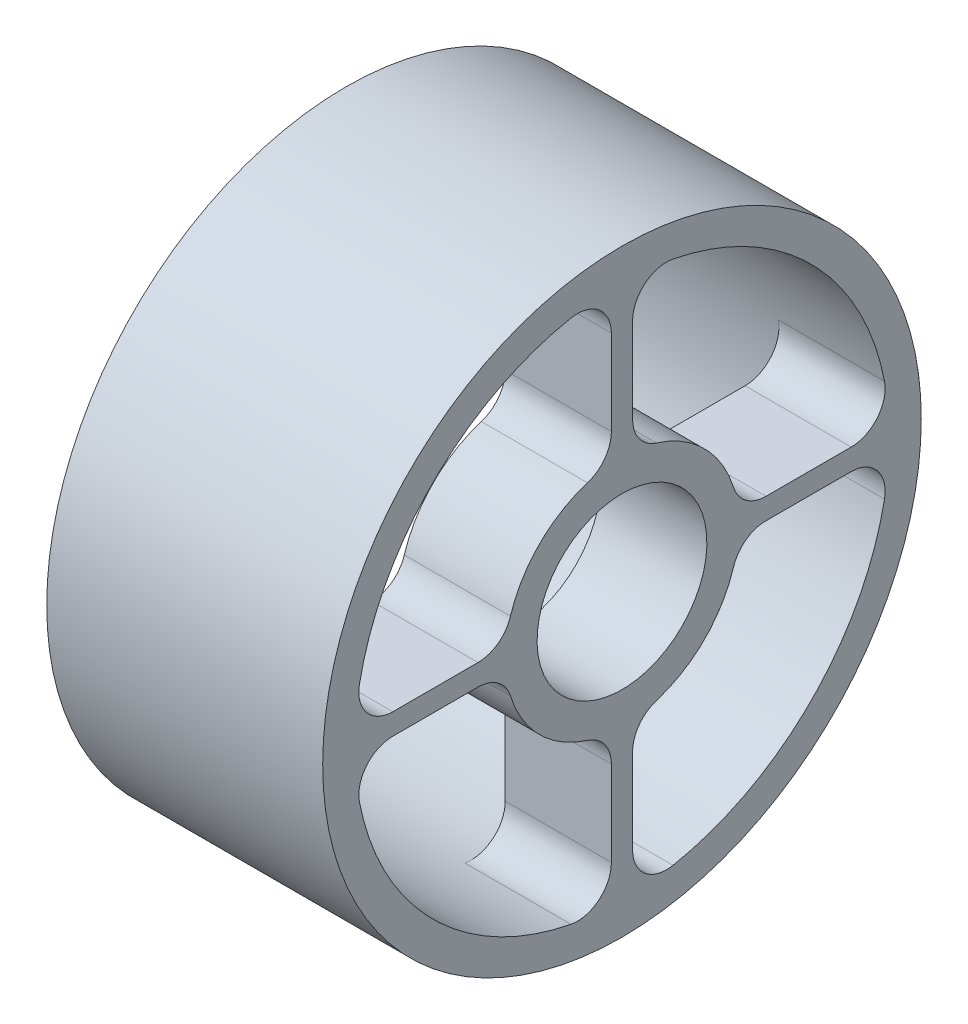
ISO-10303-21;
HEADER;
FILE_DESCRIPTION(('STEP AP214'),'2;1');
FILE_NAME('part.step','',(''),(''),'','','');
FILE_SCHEMA(('AUTOMOTIVE_DESIGN { 1 0 10303 214 1 1 1 1 }'));
ENDSEC;
DATA;
#1=APPLICATION_CONTEXT('core data for automotive mechanical design processes');
#2=APPLICATION_PROTOCOL_DEFINITION('international standard','automotive_design',2000,#1);
#3=PRODUCT_CONTEXT('',#1,'mechanical');
#4=PRODUCT('Part','Part','',(#3));
#5=PRODUCT_RELATED_PRODUCT_CATEGORY('part','',(#4));
#6=PRODUCT_DEFINITION_FORMATION('','',#4);
#7=PRODUCT_DEFINITION_CONTEXT('part definition',#1,'design');
#8=PRODUCT_DEFINITION('design','',#6,#7);
#9=PRODUCT_DEFINITION_SHAPE('','',#8);
#10=(LENGTH_UNIT() NAMED_UNIT(*) SI_UNIT(.MILLI.,.METRE.));
#11=(NAMED_UNIT(*) PLANE_ANGLE_UNIT() SI_UNIT($,.RADIAN.));
#12=(NAMED_UNIT(*) SI_UNIT($,.STERADIAN.) SOLID_ANGLE_UNIT());
#13=UNCERTAINTY_MEASURE_WITH_UNIT(LENGTH_MEASURE(1.E-05),#10,'distance_accuracy_value','');
#14=(GEOMETRIC_REPRESENTATION_CONTEXT(3) GLOBAL_UNCERTAINTY_ASSIGNED_CONTEXT((#13)) GLOBAL_UNIT_ASSIGNED_CONTEXT((#10,
#11,#12)) REPRESENTATION_CONTEXT('',''));
#15=CARTESIAN_POINT('',(0.,0.,0.));
#16=DIRECTION('',(0.,0.,1.));
#17=DIRECTION('',(1.,0.,0.));
#18=AXIS2_PLACEMENT_3D('',#15,#16,#17);
#19=CARTESIAN_POINT('',(-117.719266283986,-171.265149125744,0.));
#20=DIRECTION('',(-1.,0.,0.));
#21=DIRECTION('',(0.,-1.,0.));
#22=AXIS2_PLACEMENT_3D('',#19,#20,#21);
#23=PLANE('',#22);
#24=DIRECTION('',(0.,1.,0.));
#25=VECTOR('',#24,1.);
#26=CARTESIAN_POINT('',(-117.719266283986,-171.265149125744,-1.58750000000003));
#27=LINE('',#26,#25);
#28=CARTESIAN_POINT('',(-117.719266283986,-34.2775559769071,-1.58750000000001));
#29=VERTEX_POINT('',#28);
#30=CARTESIAN_POINT('',(-117.719266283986,-21.5338976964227,-1.58750000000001));
#31=VERTEX_POINT('',#30);
#32=EDGE_CURVE('E520',#29,#31,#27,.T.);
#33=ORIENTED_EDGE('',*,*,#32,.F.);
#34=CARTESIAN_POINT('',(-117.719266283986,-34.2775559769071,-6.66750000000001));
#35=DIRECTION('',(-1.,0.,0.));
#36=DIRECTION('',(0.,-1.,0.));
#37=AXIS2_PLACEMENT_3D('',#34,#35,#36);
#38=CIRCLE('',#37,5.08);
#39=CARTESIAN_POINT('',(-117.719266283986,-39.2640961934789,-7.63745704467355));
#40=VERTEX_POINT('',#39);
#41=EDGE_CURVE('E375',#29,#40,#38,.F.);
#42=ORIENTED_EDGE('',*,*,#41,.T.);
#43=CARTESIAN_POINT('',(-117.719266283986,0.,0.));
#44=DIRECTION('',(1.,0.,0.));
#45=DIRECTION('',(0.,1.,0.));
#46=AXIS2_PLACEMENT_3D('',#43,#44,#45);
#47=CIRCLE('',#46,40.);
#48=CARTESIAN_POINT('',(-117.719266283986,-39.2640961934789,7.63745704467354));
#49=VERTEX_POINT('',#48);
#50=EDGE_CURVE('E271',#49,#40,#47,.T.);
#51=ORIENTED_EDGE('',*,*,#50,.F.);
#52=CARTESIAN_POINT('',(-117.719266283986,-34.2775559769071,6.6675));
#53=DIRECTION('',(-1.,0.,0.));
#54=DIRECTION('',(0.,-1.,0.));
#55=AXIS2_PLACEMENT_3D('',#52,#53,#54);
#56=CIRCLE('',#55,5.08);
#57=CARTESIAN_POINT('',(-117.719266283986,-34.2775559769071,1.5875));
#58=VERTEX_POINT('',#57);
#59=EDGE_CURVE('E371',#49,#58,#56,.F.);
#60=ORIENTED_EDGE('',*,*,#59,.T.);
#61=DIRECTION('',(0.,1.,0.));
#62=VECTOR('',#61,1.);
#63=CARTESIAN_POINT('',(-117.719266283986,-171.265149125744,1.58749999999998));
#64=LINE('',#63,#62);
#65=CARTESIAN_POINT('',(-117.719266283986,-21.5338976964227,1.5875));
#66=VERTEX_POINT('',#65);
#67=EDGE_CURVE('E480',#58,#66,#64,.T.);
#68=ORIENTED_EDGE('',*,*,#67,.T.);
#69=CARTESIAN_POINT('',(-117.719266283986,-21.5338976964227,6.6675));
#70=DIRECTION('',(-1.,0.,0.));
#71=DIRECTION('',(0.,-1.,0.));
#72=AXIS2_PLACEMENT_3D('',#69,#70,#71);
#73=CIRCLE('',#72,5.08);
#74=CARTESIAN_POINT('',(-117.719266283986,-16.6811883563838,5.1649647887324));
#75=VERTEX_POINT('',#74);
#76=EDGE_CURVE('E380',#66,#75,#73,.F.);
#77=ORIENTED_EDGE('',*,*,#76,.T.);
#78=CARTESIAN_POINT('',(-117.719266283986,0.,0.));
#79=DIRECTION('',(-1.,0.,0.));
#80=DIRECTION('',(0.,-1.,0.));
#81=AXIS2_PLACEMENT_3D('',#78,#79,#80);
#82=CIRCLE('',#81,17.4625);
#83=CARTESIAN_POINT('',(-117.719266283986,-5.16496478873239,16.6811883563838));
#84=VERTEX_POINT('',#83);
#85=EDGE_CURVE('E486',#75,#84,#82,.T.);
#86=ORIENTED_EDGE('',*,*,#85,.T.);
#87=CARTESIAN_POINT('',(-117.719266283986,-6.6675,21.5338976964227));
#88=DIRECTION('',(-1.,0.,0.));
#89=DIRECTION('',(0.,-1.,0.));
#90=AXIS2_PLACEMENT_3D('',#87,#88,#89);
#91=CIRCLE('',#90,5.08);
#92=CARTESIAN_POINT('',(-117.719266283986,-1.58749999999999,21.5338976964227));
#93=VERTEX_POINT('',#92);
#94=EDGE_CURVE('E397',#84,#93,#91,.F.);
#95=ORIENTED_EDGE('',*,*,#94,.T.);
#96=DIRECTION('',(0.,0.,-1.));
#97=VECTOR('',#96,1.);
#98=CARTESIAN_POINT('',(-117.719266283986,-1.58749999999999,0.));
#99=LINE('',#98,#97);
#100=CARTESIAN_POINT('',(-117.719266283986,-1.5875,34.2775559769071));
#101=VERTEX_POINT('',#100);
#102=EDGE_CURVE('E483',#101,#93,#99,.T.);
#103=ORIENTED_EDGE('',*,*,#102,.F.);
#104=CARTESIAN_POINT('',(-117.719266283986,-6.6675,34.2775559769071));
#105=DIRECTION('',(-1.,0.,0.));
#106=DIRECTION('',(0.,-1.,0.));
#107=AXIS2_PLACEMENT_3D('',#104,#105,#106);
#108=CIRCLE('',#107,5.08);
#109=CARTESIAN_POINT('',(-117.719266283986,-7.63745704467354,39.2640961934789));
#110=VERTEX_POINT('',#109);
#111=EDGE_CURVE('E392',#101,#110,#108,.F.);
#112=ORIENTED_EDGE('',*,*,#111,.T.);
#113=CARTESIAN_POINT('',(-117.719266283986,7.63745704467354,39.2640961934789));
#114=VERTEX_POINT('',#113);
#115=EDGE_CURVE('E277',#114,#110,#47,.T.);
#116=ORIENTED_EDGE('',*,*,#115,.F.);
#117=CARTESIAN_POINT('',(-117.719266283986,6.6675,34.2775559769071));
#118=DIRECTION('',(-1.,0.,0.));
#119=DIRECTION('',(0.,-1.,0.));
#120=AXIS2_PLACEMENT_3D('',#117,#118,#119);
#121=CIRCLE('',#120,5.08);
#122=CARTESIAN_POINT('',(-117.719266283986,1.58749999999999,34.2775559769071));
#123=VERTEX_POINT('',#122);
#124=EDGE_CURVE('E388',#114,#123,#121,.F.);
#125=ORIENTED_EDGE('',*,*,#124,.T.);
#126=DIRECTION('',(0.,0.,-1.));
#127=VECTOR('',#126,1.);
#128=CARTESIAN_POINT('',(-117.719266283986,1.58749999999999,0.));
#129=LINE('',#128,#127);
#130=CARTESIAN_POINT('',(-117.719266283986,1.58749999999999,21.5338976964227));
#131=VERTEX_POINT('',#130);
#132=EDGE_CURVE('E462',#123,#131,#129,.T.);
#133=ORIENTED_EDGE('',*,*,#132,.T.);
#134=CARTESIAN_POINT('',(-117.719266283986,6.6675,21.5338976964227));
#135=DIRECTION('',(-1.,0.,0.));
#136=DIRECTION('',(0.,-1.,0.));
#137=AXIS2_PLACEMENT_3D('',#134,#135,#136);
#138=CIRCLE('',#137,5.08);
#139=CARTESIAN_POINT('',(-117.719266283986,5.16496478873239,16.6811883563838));
#140=VERTEX_POINT('',#139);
#141=EDGE_CURVE('E401',#131,#140,#138,.F.);
#142=ORIENTED_EDGE('',*,*,#141,.T.);
#143=CARTESIAN_POINT('',(-117.719266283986,0.,0.));
#144=DIRECTION('',(-1.,0.,0.));
#145=DIRECTION('',(0.,-1.,0.));
#146=AXIS2_PLACEMENT_3D('',#143,#144,#145);
#147=CIRCLE('',#146,17.4625);
#148=CARTESIAN_POINT('',(-117.719266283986,16.6811883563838,5.1649647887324));
#149=VERTEX_POINT('',#148);
#150=EDGE_CURVE('E465',#140,#149,#147,.T.);
#151=ORIENTED_EDGE('',*,*,#150,.T.);
#152=CARTESIAN_POINT('',(-117.719266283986,21.5338976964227,6.6675));
#153=DIRECTION('',(-1.,0.,0.));
#154=DIRECTION('',(0.,-1.,0.));
#155=AXIS2_PLACEMENT_3D('',#152,#153,#154);
#156=CIRCLE('',#155,5.08);
#157=CARTESIAN_POINT('',(-117.719266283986,21.5338976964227,1.5875));
#158=VERTEX_POINT('',#157);
#159=EDGE_CURVE('E410',#149,#158,#156,.F.);
#160=ORIENTED_EDGE('',*,*,#159,.T.);
#161=DIRECTION('',(0.,-1.,0.));
#162=VECTOR('',#161,1.);
#163=CARTESIAN_POINT('',(-117.719266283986,-171.265149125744,1.58750000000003));
#164=LINE('',#163,#162);
#165=CARTESIAN_POINT('',(-117.719266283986,34.2775559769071,1.5875));
#166=VERTEX_POINT('',#165);
#167=EDGE_CURVE('E459',#166,#158,#164,.T.);
#168=ORIENTED_EDGE('',*,*,#167,.F.);
#169=CARTESIAN_POINT('',(-117.719266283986,34.2775559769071,6.6675));
#170=DIRECTION('',(-1.,0.,0.));
#171=DIRECTION('',(0.,-1.,0.));
#172=AXIS2_PLACEMENT_3D('',#169,#170,#171);
#173=CIRCLE('',#172,5.08);
#174=CARTESIAN_POINT('',(-117.719266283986,39.2640961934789,7.63745704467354));
#175=VERTEX_POINT('',#174);
#176=EDGE_CURVE('E405',#166,#175,#173,.F.);
#177=ORIENTED_EDGE('',*,*,#176,.T.);
#178=CARTESIAN_POINT('',(-117.719266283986,39.2640961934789,-7.63745704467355));
#179=VERTEX_POINT('',#178);
#180=EDGE_CURVE('E504',#179,#175,#47,.T.);
#181=ORIENTED_EDGE('',*,*,#180,.F.);
#182=CARTESIAN_POINT('',(-117.719266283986,34.2775559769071,-6.66750000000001));
#183=DIRECTION('',(-1.,0.,0.));
#184=DIRECTION('',(0.,-1.,0.));
#185=AXIS2_PLACEMENT_3D('',#182,#183,#184);
#186=CIRCLE('',#185,5.08);
#187=CARTESIAN_POINT('',(-117.719266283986,34.2775559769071,-1.58750000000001));
#188=VERTEX_POINT('',#187);
#189=EDGE_CURVE('E11',#179,#188,#186,.F.);
#190=ORIENTED_EDGE('',*,*,#189,.T.);
#191=DIRECTION('',(0.,-1.,0.));
#192=VECTOR('',#191,1.);
#193=CARTESIAN_POINT('',(-117.719266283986,-171.265149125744,-1.58749999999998));
#194=LINE('',#193,#192);
#195=CARTESIAN_POINT('',(-117.719266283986,21.5338976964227,-1.58750000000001));
#196=VERTEX_POINT('',#195);
#197=EDGE_CURVE('E433',#188,#196,#194,.T.);
#198=ORIENTED_EDGE('',*,*,#197,.T.);
#199=CARTESIAN_POINT('',(-117.719266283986,21.5338976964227,-6.66750000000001));
#200=DIRECTION('',(-1.,0.,0.));
#201=DIRECTION('',(0.,-1.,0.));
#202=AXIS2_PLACEMENT_3D('',#199,#200,#201);
#203=CIRCLE('',#202,5.08);
#204=CARTESIAN_POINT('',(-117.719266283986,16.6811883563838,-5.1649647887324));
#205=VERTEX_POINT('',#204);
#206=EDGE_CURVE('E414',#196,#205,#203,.F.);
#207=ORIENTED_EDGE('',*,*,#206,.T.);
#208=CARTESIAN_POINT('',(-117.719266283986,0.,0.));
#209=DIRECTION('',(-1.,0.,0.));
#210=DIRECTION('',(0.,-1.,0.));
#211=AXIS2_PLACEMENT_3D('',#208,#209,#210);
#212=CIRCLE('',#211,17.4625);
#213=CARTESIAN_POINT('',(-117.719266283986,5.16496478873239,-16.6811883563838));
#214=VERTEX_POINT('',#213);
#215=EDGE_CURVE('E439',#205,#214,#212,.T.);
#216=ORIENTED_EDGE('',*,*,#215,.T.);
#217=CARTESIAN_POINT('',(-117.719266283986,6.6675,-21.5338976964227));
#218=DIRECTION('',(-1.,0.,0.));
#219=DIRECTION('',(0.,-1.,0.));
#220=AXIS2_PLACEMENT_3D('',#217,#218,#219);
#221=CIRCLE('',#220,5.08);
#222=CARTESIAN_POINT('',(-117.719266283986,1.58750000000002,-21.5338976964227));
#223=VERTEX_POINT('',#222);
#224=EDGE_CURVE('E367',#214,#223,#221,.F.);
#225=ORIENTED_EDGE('',*,*,#224,.T.);
#226=DIRECTION('',(0.,0.,1.));
#227=VECTOR('',#226,1.);
#228=CARTESIAN_POINT('',(-117.719266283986,1.58750000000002,0.));
#229=LINE('',#228,#227);
#230=CARTESIAN_POINT('',(-117.719266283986,1.58750000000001,-34.2775559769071));
#231=VERTEX_POINT('',#230);
#232=EDGE_CURVE('E435',#231,#223,#229,.T.);
#233=ORIENTED_EDGE('',*,*,#232,.F.);
#234=CARTESIAN_POINT('',(-117.719266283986,6.6675,-34.2775559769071));
#235=DIRECTION('',(-1.,0.,0.));
#236=DIRECTION('',(0.,-1.,0.));
#237=AXIS2_PLACEMENT_3D('',#234,#235,#236);
#238=CIRCLE('',#237,5.08);
#239=CARTESIAN_POINT('',(-117.719266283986,7.63745704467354,-39.2640961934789));
#240=VERTEX_POINT('',#239);
#241=EDGE_CURVE('E257',#231,#240,#238,.F.);
#242=ORIENTED_EDGE('',*,*,#241,.T.);
#243=CARTESIAN_POINT('',(-117.719266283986,-7.63745704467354,-39.2640961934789));
#244=VERTEX_POINT('',#243);
#245=EDGE_CURVE('E275',#244,#240,#47,.T.);
#246=ORIENTED_EDGE('',*,*,#245,.F.);
#247=CARTESIAN_POINT('',(-117.719266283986,-6.6675,-34.2775559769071));
#248=DIRECTION('',(-1.,0.,0.));
#249=DIRECTION('',(0.,-1.,0.));
#250=AXIS2_PLACEMENT_3D('',#247,#248,#249);
#251=CIRCLE('',#250,5.08);
#252=CARTESIAN_POINT('',(-117.719266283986,-1.58750000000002,-34.2775559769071));
#253=VERTEX_POINT('',#252);
#254=EDGE_CURVE('E358',#244,#253,#251,.F.);
#255=ORIENTED_EDGE('',*,*,#254,.T.);
#256=DIRECTION('',(0.,0.,1.));
#257=VECTOR('',#256,1.);
#258=CARTESIAN_POINT('',(-117.719266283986,-1.58750000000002,0.));
#259=LINE('',#258,#257);
#260=CARTESIAN_POINT('',(-117.719266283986,-1.58750000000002,-21.5338976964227));
#261=VERTEX_POINT('',#260);
#262=EDGE_CURVE('E525',#253,#261,#259,.T.);
#263=ORIENTED_EDGE('',*,*,#262,.T.);
#264=CARTESIAN_POINT('',(-117.719266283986,-6.6675,-21.5338976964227));
#265=DIRECTION('',(-1.,0.,0.));
#266=DIRECTION('',(0.,-1.,0.));
#267=AXIS2_PLACEMENT_3D('',#264,#265,#266);
#268=CIRCLE('',#267,5.08);
#269=CARTESIAN_POINT('',(-117.719266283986,-5.16496478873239,-16.6811883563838));
#270=VERTEX_POINT('',#269);
#271=EDGE_CURVE('E256',#261,#270,#268,.F.);
#272=ORIENTED_EDGE('',*,*,#271,.T.);
#273=CARTESIAN_POINT('',(-117.719266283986,0.,0.));
#274=DIRECTION('',(-1.,0.,0.));
#275=DIRECTION('',(0.,-1.,0.));
#276=AXIS2_PLACEMENT_3D('',#273,#274,#275);
#277=CIRCLE('',#276,17.4625);
#278=CARTESIAN_POINT('',(-117.719266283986,-16.6811883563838,-5.1649647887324));
#279=VERTEX_POINT('',#278);
#280=EDGE_CURVE('E517',#270,#279,#277,.T.);
#281=ORIENTED_EDGE('',*,*,#280,.T.);
#282=CARTESIAN_POINT('',(-117.719266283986,-21.5338976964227,-6.66750000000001));
#283=DIRECTION('',(-1.,0.,0.));
#284=DIRECTION('',(0.,-1.,0.));
#285=AXIS2_PLACEMENT_3D('',#282,#283,#284);
#286=CIRCLE('',#285,5.08);
#287=EDGE_CURVE('E384',#279,#31,#286,.F.);
#288=ORIENTED_EDGE('',*,*,#287,.T.);
#289=EDGE_LOOP('',(#33,#42,#51,#60,#68,#77,#86,#95,#103,#112,#116,#125,#133,#142,#151,#160,#168,
#177,#181,#190,#198,#207,#216,#225,#233,#242,#246,#255,#263,#272,#281,#288));
#290=FACE_BOUND('',#289,.T.);
#291=CARTESIAN_POINT('',(-117.719266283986,0.,0.));
#292=DIRECTION('',(1.,0.,0.));
#293=DIRECTION('',(0.,1.,0.));
#294=AXIS2_PLACEMENT_3D('',#291,#292,#293);
#295=CIRCLE('',#294,12.7);
#296=CARTESIAN_POINT('',(-117.719266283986,12.7,0.));
#297=VERTEX_POINT('',#296);
#298=EDGE_CURVE('E500',#297,#297,#295,.T.);
#299=ORIENTED_EDGE('',*,*,#298,.T.);
#300=EDGE_LOOP('',(#299));
#301=FACE_BOUND('',#300,.T.);
#302=ADVANCED_FACE('F36',(#290,#301),#23,.T.);
#303=CARTESIAN_POINT('',(-101.844266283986,-171.265149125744,0.));
#304=DIRECTION('',(1.,0.,0.));
#305=DIRECTION('',(0.,1.,0.));
#306=AXIS2_PLACEMENT_3D('',#303,#304,#305);
#307=PLANE('',#306);
#308=DIRECTION('',(0.,-1.,0.));
#309=VECTOR('',#308,1.);
#310=CARTESIAN_POINT('',(-101.844266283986,0.,-1.58750000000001));
#311=LINE('',#310,#309);
#312=CARTESIAN_POINT('',(-101.844266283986,-21.5338976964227,-1.58750000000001));
#313=VERTEX_POINT('',#312);
#314=CARTESIAN_POINT('',(-101.844266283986,-34.2775559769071,-1.58750000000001));
#315=VERTEX_POINT('',#314);
#316=EDGE_CURVE('E529',#313,#315,#311,.T.);
#317=ORIENTED_EDGE('',*,*,#316,.F.);
#318=CARTESIAN_POINT('',(-101.844266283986,-21.5338976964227,-6.66750000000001));
#319=DIRECTION('',(1.,0.,0.));
#320=DIRECTION('',(0.,1.,0.));
#321=AXIS2_PLACEMENT_3D('',#318,#319,#320);
#322=CIRCLE('',#321,5.08);
#323=CARTESIAN_POINT('',(-101.844266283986,-16.6811883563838,-5.1649647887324));
#324=VERTEX_POINT('',#323);
#325=EDGE_CURVE('E382',#313,#324,#322,.F.);
#326=ORIENTED_EDGE('',*,*,#325,.T.);
#327=CARTESIAN_POINT('',(-101.844266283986,0.,0.));
#328=DIRECTION('',(1.,0.,0.));
#329=DIRECTION('',(0.,0.,-1.));
#330=AXIS2_PLACEMENT_3D('',#327,#328,#329);
#331=CIRCLE('',#330,17.4625);
#332=CARTESIAN_POINT('',(-101.844266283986,-5.16496478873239,-16.6811883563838));
#333=VERTEX_POINT('',#332);
#334=EDGE_CURVE('E251',#324,#333,#331,.T.);
#335=ORIENTED_EDGE('',*,*,#334,.T.);
#336=CARTESIAN_POINT('',(-101.844266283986,-6.6675,-21.5338976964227));
#337=DIRECTION('',(1.,0.,0.));
#338=DIRECTION('',(0.,1.,0.));
#339=AXIS2_PLACEMENT_3D('',#336,#337,#338);
#340=CIRCLE('',#339,5.08);
#341=CARTESIAN_POINT('',(-101.844266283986,-1.5875,-21.5338976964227));
#342=VERTEX_POINT('',#341);
#343=EDGE_CURVE('E244',#333,#342,#340,.F.);
#344=ORIENTED_EDGE('',*,*,#343,.T.);
#345=DIRECTION('',(0.,0.,-1.));
#346=VECTOR('',#345,1.);
#347=CARTESIAN_POINT('',(-101.844266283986,-1.58750000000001,-98.6189213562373));
#348=LINE('',#347,#346);
#349=CARTESIAN_POINT('',(-101.844266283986,-1.5875,-34.2775559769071));
#350=VERTEX_POINT('',#349);
#351=EDGE_CURVE('E249',#342,#350,#348,.T.);
#352=ORIENTED_EDGE('',*,*,#351,.T.);
#353=CARTESIAN_POINT('',(-101.844266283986,-6.6675,-34.2775559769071));
#354=DIRECTION('',(1.,0.,0.));
#355=DIRECTION('',(0.,1.,0.));
#356=AXIS2_PLACEMENT_3D('',#353,#354,#355);
#357=CIRCLE('',#356,5.08);
#358=CARTESIAN_POINT('',(-101.844266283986,-7.63745704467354,-39.2640961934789));
#359=VERTEX_POINT('',#358);
#360=EDGE_CURVE('E356',#350,#359,#357,.F.);
#361=ORIENTED_EDGE('',*,*,#360,.T.);
#362=CARTESIAN_POINT('',(-101.844266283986,0.,0.));
#363=DIRECTION('',(1.,0.,0.));
#364=DIRECTION('',(0.,0.,-1.));
#365=AXIS2_PLACEMENT_3D('',#362,#363,#364);
#366=CIRCLE('',#365,40.);
#367=CARTESIAN_POINT('',(-101.844266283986,-39.2640961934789,-7.63745704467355));
#368=VERTEX_POINT('',#367);
#369=EDGE_CURVE('E267',#368,#359,#366,.T.);
#370=ORIENTED_EDGE('',*,*,#369,.F.);
#371=CARTESIAN_POINT('',(-101.844266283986,-34.2775559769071,-6.66750000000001));
#372=DIRECTION('',(1.,0.,0.));
#373=DIRECTION('',(0.,1.,0.));
#374=AXIS2_PLACEMENT_3D('',#371,#372,#373);
#375=CIRCLE('',#374,5.08);
#376=EDGE_CURVE('E373',#368,#315,#375,.F.);
#377=ORIENTED_EDGE('',*,*,#376,.T.);
#378=EDGE_LOOP('',(#317,#326,#335,#344,#352,#361,#370,#377));
#379=FACE_BOUND('',#378,.T.);
#380=DIRECTION('',(0.,0.,-1.));
#381=VECTOR('',#380,1.);
#382=CARTESIAN_POINT('',(-101.844266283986,1.58749999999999,-98.6189213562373));
#383=LINE('',#382,#381);
#384=CARTESIAN_POINT('',(-101.844266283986,1.5875,-21.5338976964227));
#385=VERTEX_POINT('',#384);
#386=CARTESIAN_POINT('',(-101.844266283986,1.5875,-34.2775559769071));
#387=VERTEX_POINT('',#386);
#388=EDGE_CURVE('E430',#385,#387,#383,.T.);
#389=ORIENTED_EDGE('',*,*,#388,.F.);
#390=CARTESIAN_POINT('',(-101.844266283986,6.6675,-21.5338976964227));
#391=DIRECTION('',(1.,0.,0.));
#392=DIRECTION('',(0.,1.,0.));
#393=AXIS2_PLACEMENT_3D('',#390,#391,#392);
#394=CIRCLE('',#393,5.08);
#395=CARTESIAN_POINT('',(-101.844266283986,5.16496478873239,-16.6811883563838));
#396=VERTEX_POINT('',#395);
#397=EDGE_CURVE('E365',#385,#396,#394,.F.);
#398=ORIENTED_EDGE('',*,*,#397,.T.);
#399=CARTESIAN_POINT('',(-101.844266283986,0.,0.));
#400=DIRECTION('',(1.,0.,0.));
#401=DIRECTION('',(0.,0.,-1.));
#402=AXIS2_PLACEMENT_3D('',#399,#400,#401);
#403=CIRCLE('',#402,17.4625);
#404=CARTESIAN_POINT('',(-101.844266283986,16.6811883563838,-5.1649647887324));
#405=VERTEX_POINT('',#404);
#406=EDGE_CURVE('E436',#396,#405,#403,.T.);
#407=ORIENTED_EDGE('',*,*,#406,.T.);
#408=CARTESIAN_POINT('',(-101.844266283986,21.5338976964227,-6.66750000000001));
#409=DIRECTION('',(1.,0.,0.));
#410=DIRECTION('',(0.,1.,0.));
#411=AXIS2_PLACEMENT_3D('',#408,#409,#410);
#412=CIRCLE('',#411,5.08);
#413=CARTESIAN_POINT('',(-101.844266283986,21.5338976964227,-1.58750000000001));
#414=VERTEX_POINT('',#413);
#415=EDGE_CURVE('E412',#405,#414,#412,.F.);
#416=ORIENTED_EDGE('',*,*,#415,.T.);
#417=DIRECTION('',(0.,1.,0.));
#418=VECTOR('',#417,1.);
#419=CARTESIAN_POINT('',(-101.844266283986,0.,-1.58750000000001));
#420=LINE('',#419,#418);
#421=CARTESIAN_POINT('',(-101.844266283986,34.2775559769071,-1.58750000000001));
#422=VERTEX_POINT('',#421);
#423=EDGE_CURVE('E421',#414,#422,#420,.T.);
#424=ORIENTED_EDGE('',*,*,#423,.T.);
#425=CARTESIAN_POINT('',(-101.844266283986,34.2775559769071,-6.66750000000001));
#426=DIRECTION('',(1.,0.,0.));
#427=DIRECTION('',(0.,1.,0.));
#428=AXIS2_PLACEMENT_3D('',#425,#426,#427);
#429=CIRCLE('',#428,5.08);
#430=CARTESIAN_POINT('',(-101.844266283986,39.2640961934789,-7.63745704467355));
#431=VERTEX_POINT('',#430);
#432=EDGE_CURVE('E44',#422,#431,#429,.F.);
#433=ORIENTED_EDGE('',*,*,#432,.T.);
#434=CARTESIAN_POINT('',(-101.844266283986,0.,0.));
#435=DIRECTION('',(1.,0.,0.));
#436=DIRECTION('',(0.,0.,-1.));
#437=AXIS2_PLACEMENT_3D('',#434,#435,#436);
#438=CIRCLE('',#437,40.);
#439=CARTESIAN_POINT('',(-101.844266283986,7.63745704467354,-39.2640961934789));
#440=VERTEX_POINT('',#439);
#441=EDGE_CURVE('E420',#440,#431,#438,.T.);
#442=ORIENTED_EDGE('',*,*,#441,.F.);
#443=CARTESIAN_POINT('',(-101.844266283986,6.6675,-34.2775559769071));
#444=DIRECTION('',(1.,0.,0.));
#445=DIRECTION('',(0.,1.,0.));
#446=AXIS2_PLACEMENT_3D('',#443,#444,#445);
#447=CIRCLE('',#446,5.08);
#448=EDGE_CURVE('E360',#440,#387,#447,.F.);
#449=ORIENTED_EDGE('',*,*,#448,.T.);
#450=EDGE_LOOP('',(#389,#398,#407,#416,#424,#433,#442,#449));
#451=FACE_BOUND('',#450,.T.);
#452=CARTESIAN_POINT('',(-101.844266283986,0.,0.));
#453=DIRECTION('',(1.,0.,0.));
#454=DIRECTION('',(0.,1.,0.));
#455=AXIS2_PLACEMENT_3D('',#452,#453,#454);
#456=CIRCLE('',#455,12.7);
#457=CARTESIAN_POINT('',(-101.844266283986,12.7,0.));
#458=VERTEX_POINT('',#457);
#459=EDGE_CURVE('E498',#458,#458,#456,.T.);
#460=ORIENTED_EDGE('',*,*,#459,.F.);
#461=EDGE_LOOP('',(#460));
#462=FACE_BOUND('',#461,.T.);
#463=CARTESIAN_POINT('',(-101.844266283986,0.,0.));
#464=DIRECTION('',(1.,0.,0.));
#465=DIRECTION('',(0.,1.,0.));
#466=AXIS2_PLACEMENT_3D('',#463,#464,#465);
#467=CIRCLE('',#466,44.7625);
#468=CARTESIAN_POINT('',(-101.844266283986,44.7625,0.));
#469=VERTEX_POINT('',#468);
#470=EDGE_CURVE('E495',#469,#469,#467,.T.);
#471=ORIENTED_EDGE('',*,*,#470,.T.);
#472=EDGE_LOOP('',(#471));
#473=FACE_BOUND('',#472,.T.);
#474=DIRECTION('',(0.,0.,1.));
#475=VECTOR('',#474,1.);
#476=CARTESIAN_POINT('',(-101.844266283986,-1.58749999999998,-98.6189213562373));
#477=LINE('',#476,#475);
#478=CARTESIAN_POINT('',(-101.844266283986,-1.5875,21.5338976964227));
#479=VERTEX_POINT('',#478);
#480=CARTESIAN_POINT('',(-101.844266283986,-1.5875,34.2775559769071));
#481=VERTEX_POINT('',#480);
#482=EDGE_CURVE('E468',#479,#481,#477,.T.);
#483=ORIENTED_EDGE('',*,*,#482,.F.);
#484=CARTESIAN_POINT('',(-101.844266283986,-6.6675,21.5338976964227));
#485=DIRECTION('',(1.,0.,0.));
#486=DIRECTION('',(0.,1.,0.));
#487=AXIS2_PLACEMENT_3D('',#484,#485,#486);
#488=CIRCLE('',#487,5.08);
#489=CARTESIAN_POINT('',(-101.844266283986,-5.16496478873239,16.6811883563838));
#490=VERTEX_POINT('',#489);
#491=EDGE_CURVE('E395',#479,#490,#488,.F.);
#492=ORIENTED_EDGE('',*,*,#491,.T.);
#493=CARTESIAN_POINT('',(-101.844266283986,0.,0.));
#494=DIRECTION('',(1.,0.,0.));
#495=DIRECTION('',(0.,0.,-1.));
#496=AXIS2_PLACEMENT_3D('',#493,#494,#495);
#497=CIRCLE('',#496,17.4625);
#498=CARTESIAN_POINT('',(-101.844266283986,-16.6811883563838,5.1649647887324));
#499=VERTEX_POINT('',#498);
#500=EDGE_CURVE('E477',#490,#499,#497,.T.);
#501=ORIENTED_EDGE('',*,*,#500,.T.);
#502=CARTESIAN_POINT('',(-101.844266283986,-21.5338976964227,6.6675));
#503=DIRECTION('',(1.,0.,0.));
#504=DIRECTION('',(0.,1.,0.));
#505=AXIS2_PLACEMENT_3D('',#502,#503,#504);
#506=CIRCLE('',#505,5.08);
#507=CARTESIAN_POINT('',(-101.844266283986,-21.5338976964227,1.5875));
#508=VERTEX_POINT('',#507);
#509=EDGE_CURVE('E378',#499,#508,#506,.F.);
#510=ORIENTED_EDGE('',*,*,#509,.T.);
#511=DIRECTION('',(0.,-1.,0.));
#512=VECTOR('',#511,1.);
#513=CARTESIAN_POINT('',(-101.844266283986,0.,1.58750000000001));
#514=LINE('',#513,#512);
#515=CARTESIAN_POINT('',(-101.844266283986,-34.2775559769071,1.5875));
#516=VERTEX_POINT('',#515);
#517=EDGE_CURVE('E474',#508,#516,#514,.T.);
#518=ORIENTED_EDGE('',*,*,#517,.T.);
#519=CARTESIAN_POINT('',(-101.844266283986,-34.2775559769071,6.6675));
#520=DIRECTION('',(1.,0.,0.));
#521=DIRECTION('',(0.,1.,0.));
#522=AXIS2_PLACEMENT_3D('',#519,#520,#521);
#523=CIRCLE('',#522,5.08);
#524=CARTESIAN_POINT('',(-101.844266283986,-39.2640961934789,7.63745704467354));
#525=VERTEX_POINT('',#524);
#526=EDGE_CURVE('E369',#516,#525,#523,.F.);
#527=ORIENTED_EDGE('',*,*,#526,.T.);
#528=CARTESIAN_POINT('',(-101.844266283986,0.,0.));
#529=DIRECTION('',(1.,0.,0.));
#530=DIRECTION('',(0.,0.,-1.));
#531=AXIS2_PLACEMENT_3D('',#528,#529,#530);
#532=CIRCLE('',#531,40.);
#533=CARTESIAN_POINT('',(-101.844266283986,-7.63745704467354,39.2640961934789));
#534=VERTEX_POINT('',#533);
#535=EDGE_CURVE('E471',#534,#525,#532,.T.);
#536=ORIENTED_EDGE('',*,*,#535,.F.);
#537=CARTESIAN_POINT('',(-101.844266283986,-6.6675,34.2775559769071));
#538=DIRECTION('',(1.,0.,0.));
#539=DIRECTION('',(0.,1.,0.));
#540=AXIS2_PLACEMENT_3D('',#537,#538,#539);
#541=CIRCLE('',#540,5.08);
#542=EDGE_CURVE('E390',#534,#481,#541,.F.);
#543=ORIENTED_EDGE('',*,*,#542,.T.);
#544=EDGE_LOOP('',(#483,#492,#501,#510,#518,#527,#536,#543));
#545=FACE_BOUND('',#544,.T.);
#546=DIRECTION('',(0.,1.,0.));
#547=VECTOR('',#546,1.);
#548=CARTESIAN_POINT('',(-101.844266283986,0.,1.58750000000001));
#549=LINE('',#548,#547);
#550=CARTESIAN_POINT('',(-101.844266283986,21.5338976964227,1.5875));
#551=VERTEX_POINT('',#550);
#552=CARTESIAN_POINT('',(-101.844266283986,34.2775559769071,1.5875));
#553=VERTEX_POINT('',#552);
#554=EDGE_CURVE('E450',#551,#553,#549,.T.);
#555=ORIENTED_EDGE('',*,*,#554,.F.);
#556=CARTESIAN_POINT('',(-101.844266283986,21.5338976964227,6.6675));
#557=DIRECTION('',(1.,0.,0.));
#558=DIRECTION('',(0.,1.,0.));
#559=AXIS2_PLACEMENT_3D('',#556,#557,#558);
#560=CIRCLE('',#559,5.08);
#561=CARTESIAN_POINT('',(-101.844266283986,16.6811883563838,5.1649647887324));
#562=VERTEX_POINT('',#561);
#563=EDGE_CURVE('E408',#551,#562,#560,.F.);
#564=ORIENTED_EDGE('',*,*,#563,.T.);
#565=CARTESIAN_POINT('',(-101.844266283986,0.,0.));
#566=DIRECTION('',(1.,0.,0.));
#567=DIRECTION('',(0.,0.,-1.));
#568=AXIS2_PLACEMENT_3D('',#565,#566,#567);
#569=CIRCLE('',#568,17.4625);
#570=CARTESIAN_POINT('',(-101.844266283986,5.16496478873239,16.6811883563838));
#571=VERTEX_POINT('',#570);
#572=EDGE_CURVE('E447',#562,#571,#569,.T.);
#573=ORIENTED_EDGE('',*,*,#572,.T.);
#574=CARTESIAN_POINT('',(-101.844266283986,6.6675,21.5338976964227));
#575=DIRECTION('',(1.,0.,0.));
#576=DIRECTION('',(0.,1.,0.));
#577=AXIS2_PLACEMENT_3D('',#574,#575,#576);
#578=CIRCLE('',#577,5.08);
#579=CARTESIAN_POINT('',(-101.844266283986,1.5875,21.5338976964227));
#580=VERTEX_POINT('',#579);
#581=EDGE_CURVE('E399',#571,#580,#578,.F.);
#582=ORIENTED_EDGE('',*,*,#581,.T.);
#583=DIRECTION('',(0.,0.,1.));
#584=VECTOR('',#583,1.);
#585=CARTESIAN_POINT('',(-101.844266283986,1.58750000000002,-98.6189213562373));
#586=LINE('',#585,#584);
#587=CARTESIAN_POINT('',(-101.844266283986,1.5875,34.2775559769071));
#588=VERTEX_POINT('',#587);
#589=EDGE_CURVE('E456',#580,#588,#586,.T.);
#590=ORIENTED_EDGE('',*,*,#589,.T.);
#591=CARTESIAN_POINT('',(-101.844266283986,6.6675,34.2775559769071));
#592=DIRECTION('',(1.,0.,0.));
#593=DIRECTION('',(0.,1.,0.));
#594=AXIS2_PLACEMENT_3D('',#591,#592,#593);
#595=CIRCLE('',#594,5.08);
#596=CARTESIAN_POINT('',(-101.844266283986,7.63745704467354,39.2640961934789));
#597=VERTEX_POINT('',#596);
#598=EDGE_CURVE('E386',#588,#597,#595,.F.);
#599=ORIENTED_EDGE('',*,*,#598,.T.);
#600=CARTESIAN_POINT('',(-101.844266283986,0.,0.));
#601=DIRECTION('',(1.,0.,0.));
#602=DIRECTION('',(0.,0.,-1.));
#603=AXIS2_PLACEMENT_3D('',#600,#601,#602);
#604=CIRCLE('',#603,40.);
#605=CARTESIAN_POINT('',(-101.844266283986,39.2640961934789,7.63745704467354));
#606=VERTEX_POINT('',#605);
#607=EDGE_CURVE('E453',#606,#597,#604,.T.);
#608=ORIENTED_EDGE('',*,*,#607,.F.);
#609=CARTESIAN_POINT('',(-101.844266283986,34.2775559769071,6.6675));
#610=DIRECTION('',(1.,0.,0.));
#611=DIRECTION('',(0.,1.,0.));
#612=AXIS2_PLACEMENT_3D('',#609,#610,#611);
#613=CIRCLE('',#612,5.08);
#614=EDGE_CURVE('E403',#606,#553,#613,.F.);
#615=ORIENTED_EDGE('',*,*,#614,.T.);
#616=EDGE_LOOP('',(#555,#564,#573,#582,#590,#599,#608,#615));
#617=FACE_BOUND('',#616,.T.);
#618=ADVANCED_FACE('F247',(#379,#451,#462,#473,#545,#617),#307,.T.);
#619=CARTESIAN_POINT('',(101.6,0.,0.));
#620=DIRECTION('',(1.,0.,0.));
#621=DIRECTION('',(0.,1.,0.));
#622=AXIS2_PLACEMENT_3D('',#619,#620,#621);
#623=CYLINDRICAL_SURFACE('',#622,40.);
#624=ORIENTED_EDGE('',*,*,#369,.T.);
#625=DIRECTION('',(1.,0.,0.));
#626=VECTOR('',#625,1.);
#627=CARTESIAN_POINT('',(101.6,-7.63745704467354,-39.2640961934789));
#628=LINE('',#627,#626);
#629=EDGE_CURVE('E300',#359,#244,#628,.F.);
#630=ORIENTED_EDGE('',*,*,#629,.T.);
#631=ORIENTED_EDGE('',*,*,#245,.T.);
#632=DIRECTION('',(1.,0.,0.));
#633=VECTOR('',#632,1.);
#634=CARTESIAN_POINT('',(101.6,7.63745704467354,-39.2640961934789));
#635=LINE('',#634,#633);
#636=EDGE_CURVE('E297',#240,#440,#635,.T.);
#637=ORIENTED_EDGE('',*,*,#636,.T.);
#638=ORIENTED_EDGE('',*,*,#441,.T.);
#639=DIRECTION('',(1.,0.,0.));
#640=VECTOR('',#639,1.);
#641=CARTESIAN_POINT('',(101.6,39.2640961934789,-7.63745704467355));
#642=LINE('',#641,#640);
#643=EDGE_CURVE('E273',#431,#179,#642,.F.);
#644=ORIENTED_EDGE('',*,*,#643,.T.);
#645=ORIENTED_EDGE('',*,*,#180,.T.);
#646=DIRECTION('',(1.,0.,0.));
#647=VECTOR('',#646,1.);
#648=CARTESIAN_POINT('',(101.6,39.2640961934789,7.63745704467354));
#649=LINE('',#648,#647);
#650=EDGE_CURVE('E282',#175,#606,#649,.T.);
#651=ORIENTED_EDGE('',*,*,#650,.T.);
#652=ORIENTED_EDGE('',*,*,#607,.T.);
#653=DIRECTION('',(1.,0.,0.));
#654=VECTOR('',#653,1.);
#655=CARTESIAN_POINT('',(101.6,7.63745704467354,39.2640961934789));
#656=LINE('',#655,#654);
#657=EDGE_CURVE('E288',#597,#114,#656,.F.);
#658=ORIENTED_EDGE('',*,*,#657,.T.);
#659=ORIENTED_EDGE('',*,*,#115,.T.);
#660=DIRECTION('',(1.,0.,0.));
#661=VECTOR('',#660,1.);
#662=CARTESIAN_POINT('',(101.6,-7.63745704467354,39.2640961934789));
#663=LINE('',#662,#661);
#664=EDGE_CURVE('E285',#110,#534,#663,.T.);
#665=ORIENTED_EDGE('',*,*,#664,.T.);
#666=ORIENTED_EDGE('',*,*,#535,.T.);
#667=DIRECTION('',(1.,0.,0.));
#668=VECTOR('',#667,1.);
#669=CARTESIAN_POINT('',(101.6,-39.2640961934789,7.63745704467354));
#670=LINE('',#669,#668);
#671=EDGE_CURVE('E294',#525,#49,#670,.F.);
#672=ORIENTED_EDGE('',*,*,#671,.T.);
#673=ORIENTED_EDGE('',*,*,#50,.T.);
#674=DIRECTION('',(1.,0.,0.));
#675=VECTOR('',#674,1.);
#676=CARTESIAN_POINT('',(101.6,-39.2640961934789,-7.63745704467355));
#677=LINE('',#676,#675);
#678=EDGE_CURVE('E291',#40,#368,#677,.T.);
#679=ORIENTED_EDGE('',*,*,#678,.T.);
#680=EDGE_LOOP('',(#624,#630,#631,#637,#638,#644,#645,#651,#652,#658,#659,#665,#666,#672,#673,#679));
#681=FACE_BOUND('',#680,.T.);
#682=CARTESIAN_POINT('',(-143.119266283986,0.,0.));
#683=DIRECTION('',(1.,0.,0.));
#684=DIRECTION('',(0.,1.,0.));
#685=AXIS2_PLACEMENT_3D('',#682,#683,#684);
#686=CIRCLE('',#685,40.);
#687=CARTESIAN_POINT('',(-143.119266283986,40.,0.));
#688=VERTEX_POINT('',#687);
#689=EDGE_CURVE('E489',#688,#688,#686,.T.);
#690=ORIENTED_EDGE('',*,*,#689,.F.);
#691=EDGE_LOOP('',(#690));
#692=FACE_BOUND('',#691,.T.);
#693=ADVANCED_FACE('F427',(#681,#692),#623,.F.);
#694=CARTESIAN_POINT('',(101.6,0.,0.));
#695=DIRECTION('',(1.,0.,0.));
#696=DIRECTION('',(0.,1.,0.));
#697=AXIS2_PLACEMENT_3D('',#694,#695,#696);
#698=CYLINDRICAL_SURFACE('',#697,12.7);
#699=ORIENTED_EDGE('',*,*,#298,.F.);
#700=EDGE_LOOP('',(#699));
#701=FACE_BOUND('',#700,.T.);
#702=ORIENTED_EDGE('',*,*,#459,.T.);
#703=EDGE_LOOP('',(#702));
#704=FACE_BOUND('',#703,.T.);
#705=ADVANCED_FACE('F633',(#701,#704),#698,.F.);
#706=CARTESIAN_POINT('',(101.6,0.,0.));
#707=DIRECTION('',(1.,0.,0.));
#708=DIRECTION('',(0.,1.,0.));
#709=AXIS2_PLACEMENT_3D('',#706,#707,#708);
#710=CYLINDRICAL_SURFACE('',#709,44.7625);
#711=CARTESIAN_POINT('',(-143.119266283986,0.,0.));
#712=DIRECTION('',(1.,0.,0.));
#713=DIRECTION('',(0.,1.,0.));
#714=AXIS2_PLACEMENT_3D('',#711,#712,#713);
#715=CIRCLE('',#714,44.7625);
#716=CARTESIAN_POINT('',(-143.119266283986,44.7625,0.));
#717=VERTEX_POINT('',#716);
#718=EDGE_CURVE('E492',#717,#717,#715,.T.);
#719=ORIENTED_EDGE('',*,*,#718,.T.);
#720=EDGE_LOOP('',(#719));
#721=FACE_BOUND('',#720,.T.);
#722=ORIENTED_EDGE('',*,*,#470,.F.);
#723=EDGE_LOOP('',(#722));
#724=FACE_BOUND('',#723,.T.);
#725=ADVANCED_FACE('F729',(#721,#724),#710,.T.);
#726=CARTESIAN_POINT('',(-143.119266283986,-171.265149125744,0.));
#727=DIRECTION('',(-1.,0.,0.));
#728=DIRECTION('',(0.,-1.,0.));
#729=AXIS2_PLACEMENT_3D('',#726,#727,#728);
#730=PLANE('',#729);
#731=ORIENTED_EDGE('',*,*,#689,.T.);
#732=EDGE_LOOP('',(#731));
#733=FACE_BOUND('',#732,.T.);
#734=ORIENTED_EDGE('',*,*,#718,.F.);
#735=EDGE_LOOP('',(#734));
#736=FACE_BOUND('',#735,.T.);
#737=ADVANCED_FACE('F726',(#733,#736),#730,.T.);
#738=CARTESIAN_POINT('',(-143.119266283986,-1.58749999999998,-98.6189213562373));
#739=DIRECTION('',(0.,1.,0.));
#740=DIRECTION('',(0.,0.,1.));
#741=AXIS2_PLACEMENT_3D('',#738,#739,#740);
#742=PLANE('',#741);
#743=ORIENTED_EDGE('',*,*,#482,.T.);
#744=DIRECTION('',(1.,0.,0.));
#745=VECTOR('',#744,1.);
#746=CARTESIAN_POINT('',(-143.119266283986,-1.5875,34.2775559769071));
#747=LINE('',#746,#745);
#748=EDGE_CURVE('E340',#481,#101,#747,.F.);
#749=ORIENTED_EDGE('',*,*,#748,.T.);
#750=ORIENTED_EDGE('',*,*,#102,.T.);
#751=DIRECTION('',(1.,0.,0.));
#752=VECTOR('',#751,1.);
#753=CARTESIAN_POINT('',(-143.119266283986,-1.5875,21.5338976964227));
#754=LINE('',#753,#752);
#755=EDGE_CURVE('E337',#93,#479,#754,.T.);
#756=ORIENTED_EDGE('',*,*,#755,.T.);
#757=EDGE_LOOP('',(#743,#749,#750,#756));
#758=FACE_BOUND('',#757,.T.);
#759=ADVANCED_FACE('F576',(#758),#742,.F.);
#760=CARTESIAN_POINT('',(-143.119266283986,0.,0.));
#761=DIRECTION('',(1.,0.,0.));
#762=DIRECTION('',(0.,1.,0.));
#763=AXIS2_PLACEMENT_3D('',#760,#761,#762);
#764=CYLINDRICAL_SURFACE('',#763,17.4625);
#765=ORIENTED_EDGE('',*,*,#85,.F.);
#766=DIRECTION('',(1.,0.,0.));
#767=VECTOR('',#766,1.);
#768=CARTESIAN_POINT('',(-143.119266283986,-16.6811883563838,5.1649647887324));
#769=LINE('',#768,#767);
#770=EDGE_CURVE('E329',#75,#499,#769,.T.);
#771=ORIENTED_EDGE('',*,*,#770,.T.);
#772=ORIENTED_EDGE('',*,*,#500,.F.);
#773=DIRECTION('',(1.,0.,0.));
#774=VECTOR('',#773,1.);
#775=CARTESIAN_POINT('',(-143.119266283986,-5.16496478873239,16.6811883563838));
#776=LINE('',#775,#774);
#777=EDGE_CURVE('E327',#490,#84,#776,.F.);
#778=ORIENTED_EDGE('',*,*,#777,.T.);
#779=EDGE_LOOP('',(#765,#771,#772,#778));
#780=FACE_BOUND('',#779,.T.);
#781=ADVANCED_FACE('F567',(#780),#764,.T.);
#782=CARTESIAN_POINT('',(-143.119266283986,0.,1.58750000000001));
#783=DIRECTION('',(0.,0.,1.));
#784=DIRECTION('',(0.,-1.,0.));
#785=AXIS2_PLACEMENT_3D('',#782,#783,#784);
#786=PLANE('',#785);
#787=ORIENTED_EDGE('',*,*,#67,.F.);
#788=DIRECTION('',(-1.,0.,0.));
#789=VECTOR('',#788,1.);
#790=CARTESIAN_POINT('',(-101.844266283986,-34.2775559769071,1.5875));
#791=LINE('',#790,#789);
#792=EDGE_CURVE('E319',#58,#516,#791,.F.);
#793=ORIENTED_EDGE('',*,*,#792,.T.);
#794=ORIENTED_EDGE('',*,*,#517,.F.);
#795=DIRECTION('',(-1.,0.,0.));
#796=VECTOR('',#795,1.);
#797=CARTESIAN_POINT('',(-117.719266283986,-21.5338976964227,1.5875));
#798=LINE('',#797,#796);
#799=EDGE_CURVE('E317',#508,#66,#798,.T.);
#800=ORIENTED_EDGE('',*,*,#799,.T.);
#801=EDGE_LOOP('',(#787,#793,#794,#800));
#802=FACE_BOUND('',#801,.T.);
#803=ADVANCED_FACE('F558',(#802),#786,.T.);
#804=CARTESIAN_POINT('',(-143.119266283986,0.,0.));
#805=DIRECTION('',(1.,0.,0.));
#806=DIRECTION('',(0.,1.,0.));
#807=AXIS2_PLACEMENT_3D('',#804,#805,#806);
#808=CYLINDRICAL_SURFACE('',#807,17.4625);
#809=ORIENTED_EDGE('',*,*,#150,.F.);
#810=DIRECTION('',(1.,0.,0.));
#811=VECTOR('',#810,1.);
#812=CARTESIAN_POINT('',(-143.119266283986,5.16496478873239,16.6811883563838));
#813=LINE('',#812,#811);
#814=EDGE_CURVE('E344',#140,#571,#813,.T.);
#815=ORIENTED_EDGE('',*,*,#814,.T.);
#816=ORIENTED_EDGE('',*,*,#572,.F.);
#817=DIRECTION('',(1.,0.,0.));
#818=VECTOR('',#817,1.);
#819=CARTESIAN_POINT('',(-143.119266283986,16.6811883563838,5.1649647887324));
#820=LINE('',#819,#818);
#821=EDGE_CURVE('E342',#562,#149,#820,.F.);
#822=ORIENTED_EDGE('',*,*,#821,.T.);
#823=EDGE_LOOP('',(#809,#815,#816,#822));
#824=FACE_BOUND('',#823,.T.);
#825=ADVANCED_FACE('F602',(#824),#808,.T.);
#826=CARTESIAN_POINT('',(-143.119266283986,1.58750000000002,-98.6189213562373));
#827=DIRECTION('',(0.,1.,0.));
#828=DIRECTION('',(0.,0.,1.));
#829=AXIS2_PLACEMENT_3D('',#826,#827,#828);
#830=PLANE('',#829);
#831=ORIENTED_EDGE('',*,*,#132,.F.);
#832=DIRECTION('',(-1.,0.,0.));
#833=VECTOR('',#832,1.);
#834=CARTESIAN_POINT('',(-101.844266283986,1.5875,34.2775559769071));
#835=LINE('',#834,#833);
#836=EDGE_CURVE('E334',#123,#588,#835,.F.);
#837=ORIENTED_EDGE('',*,*,#836,.T.);
#838=ORIENTED_EDGE('',*,*,#589,.F.);
#839=DIRECTION('',(-1.,0.,0.));
#840=VECTOR('',#839,1.);
#841=CARTESIAN_POINT('',(-117.719266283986,1.5875,21.5338976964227));
#842=LINE('',#841,#840);
#843=EDGE_CURVE('E332',#580,#131,#842,.T.);
#844=ORIENTED_EDGE('',*,*,#843,.T.);
#845=EDGE_LOOP('',(#831,#837,#838,#844));
#846=FACE_BOUND('',#845,.T.);
#847=ADVANCED_FACE('F591',(#846),#830,.T.);
#848=CARTESIAN_POINT('',(-143.119266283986,0.,1.58750000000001));
#849=DIRECTION('',(0.,0.,-1.));
#850=DIRECTION('',(0.,1.,0.));
#851=AXIS2_PLACEMENT_3D('',#848,#849,#850);
#852=PLANE('',#851);
#853=ORIENTED_EDGE('',*,*,#554,.T.);
#854=DIRECTION('',(1.,0.,0.));
#855=VECTOR('',#854,1.);
#856=CARTESIAN_POINT('',(-143.119266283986,34.2775559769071,1.5875));
#857=LINE('',#856,#855);
#858=EDGE_CURVE('E350',#553,#166,#857,.F.);
#859=ORIENTED_EDGE('',*,*,#858,.T.);
#860=ORIENTED_EDGE('',*,*,#167,.T.);
#861=DIRECTION('',(1.,0.,0.));
#862=VECTOR('',#861,1.);
#863=CARTESIAN_POINT('',(-143.119266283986,21.5338976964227,1.5875));
#864=LINE('',#863,#862);
#865=EDGE_CURVE('E347',#158,#551,#864,.T.);
#866=ORIENTED_EDGE('',*,*,#865,.T.);
#867=EDGE_LOOP('',(#853,#859,#860,#866));
#868=FACE_BOUND('',#867,.T.);
#869=ADVANCED_FACE('F610',(#868),#852,.F.);
#870=CARTESIAN_POINT('',(-143.119266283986,1.58749999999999,-98.6189213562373));
#871=DIRECTION('',(0.,-1.,0.));
#872=DIRECTION('',(0.,0.,-1.));
#873=AXIS2_PLACEMENT_3D('',#870,#871,#872);
#874=PLANE('',#873);
#875=ORIENTED_EDGE('',*,*,#388,.T.);
#876=DIRECTION('',(1.,0.,0.));
#877=VECTOR('',#876,1.);
#878=CARTESIAN_POINT('',(-143.119266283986,1.5875,-34.2775559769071));
#879=LINE('',#878,#877);
#880=EDGE_CURVE('E306',#387,#231,#879,.F.);
#881=ORIENTED_EDGE('',*,*,#880,.T.);
#882=ORIENTED_EDGE('',*,*,#232,.T.);
#883=DIRECTION('',(1.,0.,0.));
#884=VECTOR('',#883,1.);
#885=CARTESIAN_POINT('',(-143.119266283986,1.5875,-21.5338976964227));
#886=LINE('',#885,#884);
#887=EDGE_CURVE('E303',#223,#385,#886,.T.);
#888=ORIENTED_EDGE('',*,*,#887,.T.);
#889=EDGE_LOOP('',(#875,#881,#882,#888));
#890=FACE_BOUND('',#889,.T.);
#891=ADVANCED_FACE('F515',(#890),#874,.F.);
#892=CARTESIAN_POINT('',(-143.119266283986,0.,0.));
#893=DIRECTION('',(1.,0.,0.));
#894=DIRECTION('',(0.,1.,0.));
#895=AXIS2_PLACEMENT_3D('',#892,#893,#894);
#896=CYLINDRICAL_SURFACE('',#895,17.4625);
#897=ORIENTED_EDGE('',*,*,#406,.F.);
#898=DIRECTION('',(1.,0.,0.));
#899=VECTOR('',#898,1.);
#900=CARTESIAN_POINT('',(-143.119266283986,5.16496478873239,-16.6811883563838));
#901=LINE('',#900,#899);
#902=EDGE_CURVE('E315',#396,#214,#901,.F.);
#903=ORIENTED_EDGE('',*,*,#902,.T.);
#904=ORIENTED_EDGE('',*,*,#215,.F.);
#905=DIRECTION('',(1.,0.,0.));
#906=VECTOR('',#905,1.);
#907=CARTESIAN_POINT('',(-143.119266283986,16.6811883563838,-5.1649647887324));
#908=LINE('',#907,#906);
#909=EDGE_CURVE('E312',#205,#405,#908,.T.);
#910=ORIENTED_EDGE('',*,*,#909,.T.);
#911=EDGE_LOOP('',(#897,#903,#904,#910));
#912=FACE_BOUND('',#911,.T.);
#913=ADVANCED_FACE('F701',(#912),#896,.T.);
#914=CARTESIAN_POINT('',(-143.119266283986,0.,-1.58750000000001));
#915=DIRECTION('',(0.,0.,-1.));
#916=DIRECTION('',(0.,1.,0.));
#917=AXIS2_PLACEMENT_3D('',#914,#915,#916);
#918=PLANE('',#917);
#919=ORIENTED_EDGE('',*,*,#423,.F.);
#920=DIRECTION('',(-1.,0.,0.));
#921=VECTOR('',#920,1.);
#922=CARTESIAN_POINT('',(-117.719266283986,21.5338976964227,-1.58750000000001));
#923=LINE('',#922,#921);
#924=EDGE_CURVE('E51',#414,#196,#923,.T.);
#925=ORIENTED_EDGE('',*,*,#924,.T.);
#926=ORIENTED_EDGE('',*,*,#197,.F.);
#927=DIRECTION('',(-1.,0.,0.));
#928=VECTOR('',#927,1.);
#929=CARTESIAN_POINT('',(-101.844266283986,34.2775559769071,-1.58750000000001));
#930=LINE('',#929,#928);
#931=EDGE_CURVE('E352',#188,#422,#930,.F.);
#932=ORIENTED_EDGE('',*,*,#931,.T.);
#933=EDGE_LOOP('',(#919,#925,#926,#932));
#934=FACE_BOUND('',#933,.T.);
#935=ADVANCED_FACE('F432',(#934),#918,.T.);
#936=CARTESIAN_POINT('',(-143.119266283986,0.,-1.58750000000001));
#937=DIRECTION('',(0.,0.,1.));
#938=DIRECTION('',(0.,-1.,0.));
#939=AXIS2_PLACEMENT_3D('',#936,#937,#938);
#940=PLANE('',#939);
#941=ORIENTED_EDGE('',*,*,#316,.T.);
#942=DIRECTION('',(1.,0.,0.));
#943=VECTOR('',#942,1.);
#944=CARTESIAN_POINT('',(-143.119266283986,-34.2775559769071,-1.58750000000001));
#945=LINE('',#944,#943);
#946=EDGE_CURVE('E325',#315,#29,#945,.F.);
#947=ORIENTED_EDGE('',*,*,#946,.T.);
#948=ORIENTED_EDGE('',*,*,#32,.T.);
#949=DIRECTION('',(1.,0.,0.));
#950=VECTOR('',#949,1.);
#951=CARTESIAN_POINT('',(-143.119266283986,-21.5338976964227,-1.58750000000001));
#952=LINE('',#951,#950);
#953=EDGE_CURVE('E322',#31,#313,#952,.T.);
#954=ORIENTED_EDGE('',*,*,#953,.T.);
#955=EDGE_LOOP('',(#941,#947,#948,#954));
#956=FACE_BOUND('',#955,.T.);
#957=ADVANCED_FACE('F533',(#956),#940,.F.);
#958=CARTESIAN_POINT('',(-143.119266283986,0.,0.));
#959=DIRECTION('',(1.,0.,0.));
#960=DIRECTION('',(0.,1.,0.));
#961=AXIS2_PLACEMENT_3D('',#958,#959,#960);
#962=CYLINDRICAL_SURFACE('',#961,17.4625);
#963=ORIENTED_EDGE('',*,*,#280,.F.);
#964=DIRECTION('',(1.,0.,0.));
#965=VECTOR('',#964,1.);
#966=CARTESIAN_POINT('',(-143.119266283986,-5.16496478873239,-16.6811883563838));
#967=LINE('',#966,#965);
#968=EDGE_CURVE('E310',#270,#333,#967,.T.);
#969=ORIENTED_EDGE('',*,*,#968,.T.);
#970=ORIENTED_EDGE('',*,*,#334,.F.);
#971=DIRECTION('',(1.,0.,0.));
#972=VECTOR('',#971,1.);
#973=CARTESIAN_POINT('',(-143.119266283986,-16.6811883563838,-5.1649647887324));
#974=LINE('',#973,#972);
#975=EDGE_CURVE('E308',#324,#279,#974,.F.);
#976=ORIENTED_EDGE('',*,*,#975,.T.);
#977=EDGE_LOOP('',(#963,#969,#970,#976));
#978=FACE_BOUND('',#977,.T.);
#979=ADVANCED_FACE('F545',(#978),#962,.T.);
#980=CARTESIAN_POINT('',(-143.119266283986,-1.58750000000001,-98.6189213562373));
#981=DIRECTION('',(0.,-1.,0.));
#982=DIRECTION('',(0.,0.,-1.));
#983=AXIS2_PLACEMENT_3D('',#980,#981,#982);
#984=PLANE('',#983);
#985=ORIENTED_EDGE('',*,*,#262,.F.);
#986=DIRECTION('',(-1.,0.,0.));
#987=VECTOR('',#986,1.);
#988=CARTESIAN_POINT('',(-101.844266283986,-1.5875,-34.2775559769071));
#989=LINE('',#988,#987);
#990=EDGE_CURVE('E266',#253,#350,#989,.F.);
#991=ORIENTED_EDGE('',*,*,#990,.T.);
#992=ORIENTED_EDGE('',*,*,#351,.F.);
#993=DIRECTION('',(-1.,0.,0.));
#994=VECTOR('',#993,1.);
#995=CARTESIAN_POINT('',(-117.719266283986,-1.5875,-21.5338976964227));
#996=LINE('',#995,#994);
#997=EDGE_CURVE('E263',#342,#261,#996,.T.);
#998=ORIENTED_EDGE('',*,*,#997,.T.);
#999=EDGE_LOOP('',(#985,#991,#992,#998));
#1000=FACE_BOUND('',#999,.T.);
#1001=ADVANCED_FACE('F262',(#1000),#984,.T.);
#1002=CARTESIAN_POINT('',(101.6,-6.6675,-34.2775559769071));
#1003=DIRECTION('',(1.,0.,0.));
#1004=DIRECTION('',(0.,1.,0.));
#1005=AXIS2_PLACEMENT_3D('',#1002,#1003,#1004);
#1006=CYLINDRICAL_SURFACE('',#1005,5.08);
#1007=ORIENTED_EDGE('',*,*,#254,.F.);
#1008=ORIENTED_EDGE('',*,*,#629,.F.);
#1009=ORIENTED_EDGE('',*,*,#360,.F.);
#1010=ORIENTED_EDGE('',*,*,#990,.F.);
#1011=EDGE_LOOP('',(#1007,#1008,#1009,#1010));
#1012=FACE_BOUND('',#1011,.T.);
#1013=ADVANCED_FACE('F547',(#1012),#1006,.F.);
#1014=CARTESIAN_POINT('',(101.6,6.6675,-34.2775559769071));
#1015=DIRECTION('',(1.,0.,0.));
#1016=DIRECTION('',(0.,1.,0.));
#1017=AXIS2_PLACEMENT_3D('',#1014,#1015,#1016);
#1018=CYLINDRICAL_SURFACE('',#1017,5.08);
#1019=ORIENTED_EDGE('',*,*,#241,.F.);
#1020=ORIENTED_EDGE('',*,*,#880,.F.);
#1021=ORIENTED_EDGE('',*,*,#448,.F.);
#1022=ORIENTED_EDGE('',*,*,#636,.F.);
#1023=EDGE_LOOP('',(#1019,#1020,#1021,#1022));
#1024=FACE_BOUND('',#1023,.T.);
#1025=ADVANCED_FACE('F512',(#1024),#1018,.F.);
#1026=CARTESIAN_POINT('',(-143.119266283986,-6.6675,-21.5338976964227));
#1027=DIRECTION('',(1.,0.,0.));
#1028=DIRECTION('',(0.,1.,0.));
#1029=AXIS2_PLACEMENT_3D('',#1026,#1027,#1028);
#1030=CYLINDRICAL_SURFACE('',#1029,5.08);
#1031=ORIENTED_EDGE('',*,*,#271,.F.);
#1032=ORIENTED_EDGE('',*,*,#997,.F.);
#1033=ORIENTED_EDGE('',*,*,#343,.F.);
#1034=ORIENTED_EDGE('',*,*,#968,.F.);
#1035=EDGE_LOOP('',(#1031,#1032,#1033,#1034));
#1036=FACE_BOUND('',#1035,.T.);
#1037=ADVANCED_FACE('F270',(#1036),#1030,.F.);
#1038=CARTESIAN_POINT('',(-143.119266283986,6.6675,-21.5338976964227));
#1039=DIRECTION('',(1.,0.,0.));
#1040=DIRECTION('',(0.,1.,0.));
#1041=AXIS2_PLACEMENT_3D('',#1038,#1039,#1040);
#1042=CYLINDRICAL_SURFACE('',#1041,5.08);
#1043=ORIENTED_EDGE('',*,*,#224,.F.);
#1044=ORIENTED_EDGE('',*,*,#902,.F.);
#1045=ORIENTED_EDGE('',*,*,#397,.F.);
#1046=ORIENTED_EDGE('',*,*,#887,.F.);
#1047=EDGE_LOOP('',(#1043,#1044,#1045,#1046));
#1048=FACE_BOUND('',#1047,.T.);
#1049=ADVANCED_FACE('F642',(#1048),#1042,.F.);
#1050=CARTESIAN_POINT('',(101.6,-34.2775559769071,6.6675));
#1051=DIRECTION('',(1.,0.,0.));
#1052=DIRECTION('',(0.,1.,0.));
#1053=AXIS2_PLACEMENT_3D('',#1050,#1051,#1052);
#1054=CYLINDRICAL_SURFACE('',#1053,5.08);
#1055=ORIENTED_EDGE('',*,*,#59,.F.);
#1056=ORIENTED_EDGE('',*,*,#671,.F.);
#1057=ORIENTED_EDGE('',*,*,#526,.F.);
#1058=ORIENTED_EDGE('',*,*,#792,.F.);
#1059=EDGE_LOOP('',(#1055,#1056,#1057,#1058));
#1060=FACE_BOUND('',#1059,.T.);
#1061=ADVANCED_FACE('F554',(#1060),#1054,.F.);
#1062=CARTESIAN_POINT('',(101.6,-34.2775559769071,-6.66750000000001));
#1063=DIRECTION('',(1.,0.,0.));
#1064=DIRECTION('',(0.,1.,0.));
#1065=AXIS2_PLACEMENT_3D('',#1062,#1063,#1064);
#1066=CYLINDRICAL_SURFACE('',#1065,5.08);
#1067=ORIENTED_EDGE('',*,*,#41,.F.);
#1068=ORIENTED_EDGE('',*,*,#946,.F.);
#1069=ORIENTED_EDGE('',*,*,#376,.F.);
#1070=ORIENTED_EDGE('',*,*,#678,.F.);
#1071=EDGE_LOOP('',(#1067,#1068,#1069,#1070));
#1072=FACE_BOUND('',#1071,.T.);
#1073=ADVANCED_FACE('F537',(#1072),#1066,.F.);
#1074=CARTESIAN_POINT('',(-143.119266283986,-21.5338976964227,6.6675));
#1075=DIRECTION('',(1.,0.,0.));
#1076=DIRECTION('',(0.,1.,0.));
#1077=AXIS2_PLACEMENT_3D('',#1074,#1075,#1076);
#1078=CYLINDRICAL_SURFACE('',#1077,5.08);
#1079=ORIENTED_EDGE('',*,*,#76,.F.);
#1080=ORIENTED_EDGE('',*,*,#799,.F.);
#1081=ORIENTED_EDGE('',*,*,#509,.F.);
#1082=ORIENTED_EDGE('',*,*,#770,.F.);
#1083=EDGE_LOOP('',(#1079,#1080,#1081,#1082));
#1084=FACE_BOUND('',#1083,.T.);
#1085=ADVANCED_FACE('F562',(#1084),#1078,.F.);
#1086=CARTESIAN_POINT('',(-143.119266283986,-21.5338976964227,-6.66750000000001));
#1087=DIRECTION('',(1.,0.,0.));
#1088=DIRECTION('',(0.,1.,0.));
#1089=AXIS2_PLACEMENT_3D('',#1086,#1087,#1088);
#1090=CYLINDRICAL_SURFACE('',#1089,5.08);
#1091=ORIENTED_EDGE('',*,*,#287,.F.);
#1092=ORIENTED_EDGE('',*,*,#975,.F.);
#1093=ORIENTED_EDGE('',*,*,#325,.F.);
#1094=ORIENTED_EDGE('',*,*,#953,.F.);
#1095=EDGE_LOOP('',(#1091,#1092,#1093,#1094));
#1096=FACE_BOUND('',#1095,.T.);
#1097=ADVANCED_FACE('F541',(#1096),#1090,.F.);
#1098=CARTESIAN_POINT('',(101.6,6.6675,34.2775559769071));
#1099=DIRECTION('',(1.,0.,0.));
#1100=DIRECTION('',(0.,1.,0.));
#1101=AXIS2_PLACEMENT_3D('',#1098,#1099,#1100);
#1102=CYLINDRICAL_SURFACE('',#1101,5.08);
#1103=ORIENTED_EDGE('',*,*,#124,.F.);
#1104=ORIENTED_EDGE('',*,*,#657,.F.);
#1105=ORIENTED_EDGE('',*,*,#598,.F.);
#1106=ORIENTED_EDGE('',*,*,#836,.F.);
#1107=EDGE_LOOP('',(#1103,#1104,#1105,#1106));
#1108=FACE_BOUND('',#1107,.T.);
#1109=ADVANCED_FACE('F588',(#1108),#1102,.F.);
#1110=CARTESIAN_POINT('',(101.6,-6.6675,34.2775559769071));
#1111=DIRECTION('',(1.,0.,0.));
#1112=DIRECTION('',(0.,1.,0.));
#1113=AXIS2_PLACEMENT_3D('',#1110,#1111,#1112);
#1114=CYLINDRICAL_SURFACE('',#1113,5.08);
#1115=ORIENTED_EDGE('',*,*,#111,.F.);
#1116=ORIENTED_EDGE('',*,*,#748,.F.);
#1117=ORIENTED_EDGE('',*,*,#542,.F.);
#1118=ORIENTED_EDGE('',*,*,#664,.F.);
#1119=EDGE_LOOP('',(#1115,#1116,#1117,#1118));
#1120=FACE_BOUND('',#1119,.T.);
#1121=ADVANCED_FACE('F580',(#1120),#1114,.F.);
#1122=CARTESIAN_POINT('',(-143.119266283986,-6.6675,21.5338976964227));
#1123=DIRECTION('',(1.,0.,0.));
#1124=DIRECTION('',(0.,1.,0.));
#1125=AXIS2_PLACEMENT_3D('',#1122,#1123,#1124);
#1126=CYLINDRICAL_SURFACE('',#1125,5.08);
#1127=ORIENTED_EDGE('',*,*,#94,.F.);
#1128=ORIENTED_EDGE('',*,*,#777,.F.);
#1129=ORIENTED_EDGE('',*,*,#491,.F.);
#1130=ORIENTED_EDGE('',*,*,#755,.F.);
#1131=EDGE_LOOP('',(#1127,#1128,#1129,#1130));
#1132=FACE_BOUND('',#1131,.T.);
#1133=ADVANCED_FACE('F571',(#1132),#1126,.F.);
#1134=CARTESIAN_POINT('',(-143.119266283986,6.6675,21.5338976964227));
#1135=DIRECTION('',(1.,0.,0.));
#1136=DIRECTION('',(0.,1.,0.));
#1137=AXIS2_PLACEMENT_3D('',#1134,#1135,#1136);
#1138=CYLINDRICAL_SURFACE('',#1137,5.08);
#1139=ORIENTED_EDGE('',*,*,#141,.F.);
#1140=ORIENTED_EDGE('',*,*,#843,.F.);
#1141=ORIENTED_EDGE('',*,*,#581,.F.);
#1142=ORIENTED_EDGE('',*,*,#814,.F.);
#1143=EDGE_LOOP('',(#1139,#1140,#1141,#1142));
#1144=FACE_BOUND('',#1143,.T.);
#1145=ADVANCED_FACE('F599',(#1144),#1138,.F.);
#1146=CARTESIAN_POINT('',(101.6,34.2775559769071,6.6675));
#1147=DIRECTION('',(1.,0.,0.));
#1148=DIRECTION('',(0.,1.,0.));
#1149=AXIS2_PLACEMENT_3D('',#1146,#1147,#1148);
#1150=CYLINDRICAL_SURFACE('',#1149,5.08);
#1151=ORIENTED_EDGE('',*,*,#176,.F.);
#1152=ORIENTED_EDGE('',*,*,#858,.F.);
#1153=ORIENTED_EDGE('',*,*,#614,.F.);
#1154=ORIENTED_EDGE('',*,*,#650,.F.);
#1155=EDGE_LOOP('',(#1151,#1152,#1153,#1154));
#1156=FACE_BOUND('',#1155,.T.);
#1157=ADVANCED_FACE('F615',(#1156),#1150,.F.);
#1158=CARTESIAN_POINT('',(-143.119266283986,21.5338976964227,6.6675));
#1159=DIRECTION('',(1.,0.,0.));
#1160=DIRECTION('',(0.,1.,0.));
#1161=AXIS2_PLACEMENT_3D('',#1158,#1159,#1160);
#1162=CYLINDRICAL_SURFACE('',#1161,5.08);
#1163=ORIENTED_EDGE('',*,*,#159,.F.);
#1164=ORIENTED_EDGE('',*,*,#821,.F.);
#1165=ORIENTED_EDGE('',*,*,#563,.F.);
#1166=ORIENTED_EDGE('',*,*,#865,.F.);
#1167=EDGE_LOOP('',(#1163,#1164,#1165,#1166));
#1168=FACE_BOUND('',#1167,.T.);
#1169=ADVANCED_FACE('F608',(#1168),#1162,.F.);
#1170=CARTESIAN_POINT('',(-143.119266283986,21.5338976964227,-6.66750000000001));
#1171=DIRECTION('',(1.,0.,0.));
#1172=DIRECTION('',(0.,1.,0.));
#1173=AXIS2_PLACEMENT_3D('',#1170,#1171,#1172);
#1174=CYLINDRICAL_SURFACE('',#1173,5.08);
#1175=ORIENTED_EDGE('',*,*,#206,.F.);
#1176=ORIENTED_EDGE('',*,*,#924,.F.);
#1177=ORIENTED_EDGE('',*,*,#415,.F.);
#1178=ORIENTED_EDGE('',*,*,#909,.F.);
#1179=EDGE_LOOP('',(#1175,#1176,#1177,#1178));
#1180=FACE_BOUND('',#1179,.T.);
#1181=ADVANCED_FACE('F622',(#1180),#1174,.F.);
#1182=CARTESIAN_POINT('',(101.6,34.2775559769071,-6.66750000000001));
#1183=DIRECTION('',(1.,0.,0.));
#1184=DIRECTION('',(0.,1.,0.));
#1185=AXIS2_PLACEMENT_3D('',#1182,#1183,#1184);
#1186=CYLINDRICAL_SURFACE('',#1185,5.08);
#1187=ORIENTED_EDGE('',*,*,#189,.F.);
#1188=ORIENTED_EDGE('',*,*,#643,.F.);
#1189=ORIENTED_EDGE('',*,*,#432,.F.);
#1190=ORIENTED_EDGE('',*,*,#931,.F.);
#1191=EDGE_LOOP('',(#1187,#1188,#1189,#1190));
#1192=FACE_BOUND('',#1191,.T.);
#1193=ADVANCED_FACE('F38',(#1192),#1186,.F.);
#1194=CLOSED_SHELL('',(#302,#618,#693,#705,#725,#737,#759,#781,#803,#825,#847,#869,#891,#913,
#935,#957,#979,#1001,#1013,#1025,#1037,#1049,#1061,#1073,#1085,#1097,#1109,#1121,#1133,#1145,
#1157,#1169,#1181,#1193));
#1195=MANIFOLD_SOLID_BREP('B2',#1194);
#1196=ADVANCED_BREP_SHAPE_REPRESENTATION('',(#18,#1195),#14);
#1197=SHAPE_DEFINITION_REPRESENTATION(#9,#1196);
ENDSEC;
END-ISO-10303-21;
